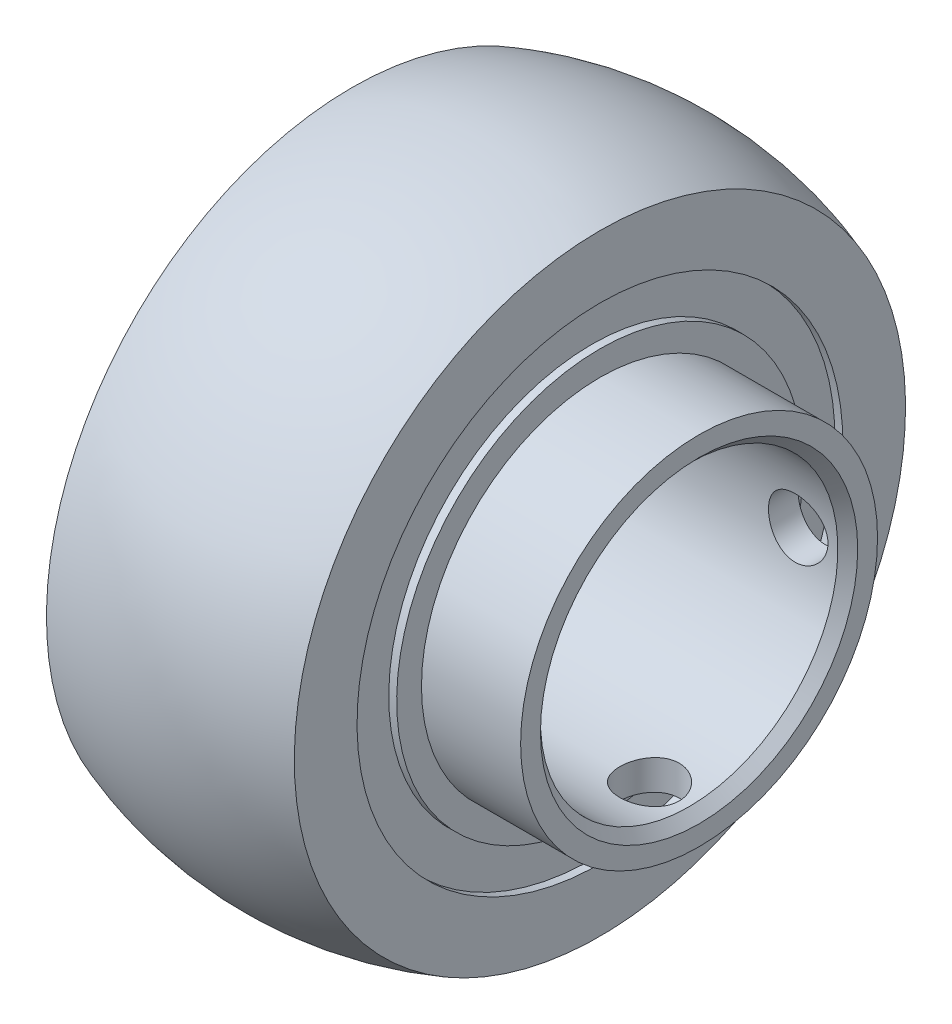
from build123d import *

# Parameters (mm, degrees)
ESQUISSE4_R             = 3
ENL_V_MAT_EXTRU_4_DEPTH = 40
ESQUISSE5_R             = 3
ENL_V_MAT_EXTRU_5_DEPTH = 40


with BuildPart() as part:
    # Esquisse3 → Base-R_volution (revolve)
    with BuildSketch(Plane.XY):
        with BuildLine():
            Line((21.5, 15), (-16.5, 15))
            Line((-16.5, 15), (-17.5, 16))
            Line((-17.5, 16), (-17.5, 18))
            Line((-17.5, 18), (-12.5, 18))
            Line((-12.5, 18), (-12.5, 20.5))
            Line((-12.5, 20.5), (-11.7, 20.5))
            Line((-11.7, 20.5), (-11.7, 24.5))
            Line((-11.7, 24.5), (-12.5, 24.5))
            Line((-12.5, 24.5), (-12.5, 30.824560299))
            ThreePointArc((-12.5, 30.824560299), (0, 33), (12.5, 30.824560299))
            Line((12.5, 30.824560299), (12.5, 24.5))
            Line((12.5, 24.5), (11.7, 24.5))
            Line((11.7, 24.5), (11.7, 20.5))
            Line((11.7, 20.5), (12.5, 20.5))
            Line((12.5, 20.5), (12.5, 18))
            Line((12.5, 18), (22.5, 18))
            Line((22.5, 18), (22.5, 16))
            Line((22.5, 16), (21.5, 15))
        make_face()
    revolve(axis=Axis((13, 0, 0), (-1, 0, 0)))

    # Esquisse4 → Enl_v. mat.-Extru.4 (cut)
    with BuildSketch(Plane.XY):
        with Locations((17.5, 0)):
            Circle(ESQUISSE4_R)
    extrude(amount=-ENL_V_MAT_EXTRU_4_DEPTH, mode=Mode.SUBTRACT)

    # Esquisse5 → Enl_v. mat.-Extru.5 (cut)
    with BuildSketch(Plane(origin=(0, 0, 0), x_dir=(1, 0, 0), z_dir=(0, 1, 0))):
        with Locations(Location((17.5, 0, 0), (0, 0, 270))):
            Circle(ESQUISSE5_R)
    extrude(amount=-ENL_V_MAT_EXTRU_5_DEPTH, mode=Mode.SUBTRACT)


solid = part.part
